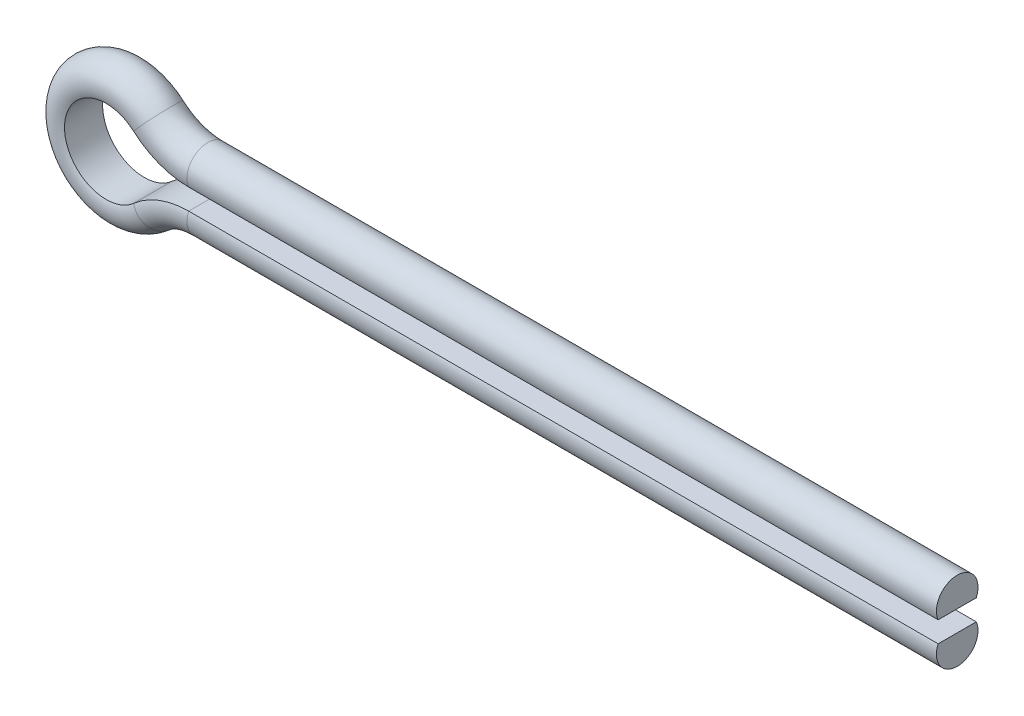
ISO-10303-21;
HEADER;
FILE_DESCRIPTION(('STEP AP214'),'2;1');
FILE_NAME('part.step','',(''),(''),'','','');
FILE_SCHEMA(('AUTOMOTIVE_DESIGN { 1 0 10303 214 1 1 1 1 }'));
ENDSEC;
DATA;
#1=APPLICATION_CONTEXT('core data for automotive mechanical design processes');
#2=APPLICATION_PROTOCOL_DEFINITION('international standard','automotive_design',2000,#1);
#3=PRODUCT_CONTEXT('',#1,'mechanical');
#4=PRODUCT('Part','Part','',(#3));
#5=PRODUCT_RELATED_PRODUCT_CATEGORY('part','',(#4));
#6=PRODUCT_DEFINITION_FORMATION('','',#4);
#7=PRODUCT_DEFINITION_CONTEXT('part definition',#1,'design');
#8=PRODUCT_DEFINITION('design','',#6,#7);
#9=PRODUCT_DEFINITION_SHAPE('','',#8);
#10=(LENGTH_UNIT() NAMED_UNIT(*) SI_UNIT(.MILLI.,.METRE.));
#11=(NAMED_UNIT(*) PLANE_ANGLE_UNIT() SI_UNIT($,.RADIAN.));
#12=(NAMED_UNIT(*) SI_UNIT($,.STERADIAN.) SOLID_ANGLE_UNIT());
#13=UNCERTAINTY_MEASURE_WITH_UNIT(LENGTH_MEASURE(1.E-05),#10,'distance_accuracy_value','');
#14=(GEOMETRIC_REPRESENTATION_CONTEXT(3) GLOBAL_UNCERTAINTY_ASSIGNED_CONTEXT((#13)) GLOBAL_UNIT_ASSIGNED_CONTEXT((#10,
#11,#12)) REPRESENTATION_CONTEXT('',''));
#15=CARTESIAN_POINT('',(0.,0.,0.));
#16=DIRECTION('',(0.,0.,1.));
#17=DIRECTION('',(1.,0.,0.));
#18=AXIS2_PLACEMENT_3D('',#15,#16,#17);
#19=CARTESIAN_POINT('',(9.92156741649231,-1.24999999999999,-2.29128784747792));
#20=DIRECTION('',(0.,1.,0.));
#21=DIRECTION('',(-1.,0.,0.));
#22=AXIS2_PLACEMENT_3D('',#19,#20,#21);
#23=PLANE('',#22);
#24=DIRECTION('',(0.,0.,1.));
#25=VECTOR('',#24,1.);
#26=CARTESIAN_POINT('',(9.92156741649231,-1.24999999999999,-2.29128784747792));
#27=LINE('',#26,#25);
#28=CARTESIAN_POINT('',(9.92156741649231,-1.24999999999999,-2.29128784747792));
#29=VERTEX_POINT('',#28);
#30=CARTESIAN_POINT('',(9.92156741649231,-1.24999999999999,2.29128784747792));
#31=VERTEX_POINT('',#30);
#32=EDGE_CURVE('E132',#29,#31,#27,.T.);
#33=ORIENTED_EDGE('',*,*,#32,.T.);
#34=DIRECTION('',(1.,0.,0.));
#35=VECTOR('',#34,1.);
#36=CARTESIAN_POINT('',(9.92156741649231,-1.24999999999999,2.29128784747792));
#37=LINE('',#36,#35);
#38=CARTESIAN_POINT('',(100.,-1.25,2.29128784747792));
#39=VERTEX_POINT('',#38);
#40=EDGE_CURVE('E35',#31,#39,#37,.T.);
#41=ORIENTED_EDGE('',*,*,#40,.T.);
#42=DIRECTION('',(0.,0.,1.));
#43=VECTOR('',#42,1.);
#44=CARTESIAN_POINT('',(100.,-1.25,-2.29128784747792));
#45=LINE('',#44,#43);
#46=CARTESIAN_POINT('',(100.,-1.25,-2.29128784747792));
#47=VERTEX_POINT('',#46);
#48=EDGE_CURVE('E42',#47,#39,#45,.T.);
#49=ORIENTED_EDGE('',*,*,#48,.F.);
#50=DIRECTION('',(1.,0.,0.));
#51=VECTOR('',#50,1.);
#52=CARTESIAN_POINT('',(9.92156741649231,-1.24999999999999,-2.29128784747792));
#53=LINE('',#52,#51);
#54=EDGE_CURVE('E11',#29,#47,#53,.T.);
#55=ORIENTED_EDGE('',*,*,#54,.F.);
#56=EDGE_LOOP('',(#33,#41,#49,#55));
#57=FACE_BOUND('',#56,.T.);
#58=ADVANCED_FACE('F28',(#57),#23,.T.);
#59=CARTESIAN_POINT('',(9.92156741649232,-2.24999999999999,0.));
#60=DIRECTION('',(1.,0.,0.));
#61=DIRECTION('',(0.,1.,0.));
#62=AXIS2_PLACEMENT_3D('',#59,#60,#61);
#63=CYLINDRICAL_SURFACE('',#62,2.5);
#64=CARTESIAN_POINT('',(9.92156741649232,-2.24999999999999,0.));
#65=DIRECTION('',(1.,0.,0.));
#66=DIRECTION('',(0.,1.,0.));
#67=AXIS2_PLACEMENT_3D('',#64,#65,#66);
#68=CIRCLE('',#67,2.5);
#69=EDGE_CURVE('E129',#31,#29,#68,.T.);
#70=ORIENTED_EDGE('',*,*,#69,.T.);
#71=ORIENTED_EDGE('',*,*,#54,.T.);
#72=CARTESIAN_POINT('',(100.,-2.25,0.));
#73=DIRECTION('',(1.,0.,0.));
#74=DIRECTION('',(0.,1.,0.));
#75=AXIS2_PLACEMENT_3D('',#72,#73,#74);
#76=CIRCLE('',#75,2.5);
#77=EDGE_CURVE('E48',#39,#47,#76,.T.);
#78=ORIENTED_EDGE('',*,*,#77,.F.);
#79=ORIENTED_EDGE('',*,*,#40,.F.);
#80=EDGE_LOOP('',(#70,#71,#78,#79));
#81=FACE_BOUND('',#80,.T.);
#82=ADVANCED_FACE('F144',(#81),#63,.T.);
#83=CARTESIAN_POINT('',(9.92156741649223,-11.25,0.));
#84=DIRECTION('',(0.,0.,-1.));
#85=DIRECTION('',(-1.,0.,0.));
#86=AXIS2_PLACEMENT_3D('',#83,#84,#85);
#87=CYLINDRICAL_SURFACE('',#86,10.);
#88=DIRECTION('',(0.,0.,1.));
#89=VECTOR('',#88,1.);
#90=CARTESIAN_POINT('',(3.3071891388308,-3.74999999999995,-2.29128784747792));
#91=LINE('',#90,#89);
#92=CARTESIAN_POINT('',(3.3071891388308,-3.74999999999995,-2.29128784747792));
#93=VERTEX_POINT('',#92);
#94=CARTESIAN_POINT('',(3.3071891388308,-3.74999999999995,2.29128784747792));
#95=VERTEX_POINT('',#94);
#96=EDGE_CURVE('E120',#93,#95,#91,.T.);
#97=ORIENTED_EDGE('',*,*,#96,.T.);
#98=CARTESIAN_POINT('',(9.92156741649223,-11.25,2.29128784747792));
#99=DIRECTION('',(0.,0.,-1.));
#100=DIRECTION('',(-1.,0.,0.));
#101=AXIS2_PLACEMENT_3D('',#98,#99,#100);
#102=CIRCLE('',#101,10.);
#103=EDGE_CURVE('E135',#95,#31,#102,.T.);
#104=ORIENTED_EDGE('',*,*,#103,.T.);
#105=ORIENTED_EDGE('',*,*,#32,.F.);
#106=CARTESIAN_POINT('',(9.92156741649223,-11.25,-2.29128784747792));
#107=DIRECTION('',(0.,0.,-1.));
#108=DIRECTION('',(-1.,0.,0.));
#109=AXIS2_PLACEMENT_3D('',#106,#107,#108);
#110=CIRCLE('',#109,10.);
#111=EDGE_CURVE('E138',#93,#29,#110,.T.);
#112=ORIENTED_EDGE('',*,*,#111,.F.);
#113=EDGE_LOOP('',(#97,#104,#105,#112));
#114=FACE_BOUND('',#113,.T.);
#115=ADVANCED_FACE('F147',(#114),#87,.T.);
#116=CARTESIAN_POINT('',(9.92156741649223,-11.25,0.));
#117=DIRECTION('',(0.,0.,-1.));
#118=DIRECTION('',(-1.,0.,0.));
#119=AXIS2_PLACEMENT_3D('',#116,#117,#118);
#120=TOROIDAL_SURFACE('',#119,9.,2.5);
#121=CARTESIAN_POINT('',(3.96862696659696,-4.49999999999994,0.));
#122=DIRECTION('',(0.74999999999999,0.661437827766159,0.));
#123=DIRECTION('',(-0.661437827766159,0.74999999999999,0.));
#124=AXIS2_PLACEMENT_3D('',#121,#122,#123);
#125=CIRCLE('',#124,2.5);
#126=EDGE_CURVE('E117',#95,#93,#125,.T.);
#127=ORIENTED_EDGE('',*,*,#126,.T.);
#128=ORIENTED_EDGE('',*,*,#111,.T.);
#129=ORIENTED_EDGE('',*,*,#69,.F.);
#130=ORIENTED_EDGE('',*,*,#103,.F.);
#131=EDGE_LOOP('',(#127,#128,#129,#130));
#132=FACE_BOUND('',#131,.T.);
#133=ADVANCED_FACE('F148',(#132),#120,.T.);
#134=CARTESIAN_POINT('',(0.,0.,0.));
#135=DIRECTION('',(0.,0.,1.));
#136=DIRECTION('',(1.,0.,0.));
#137=AXIS2_PLACEMENT_3D('',#134,#135,#136);
#138=CYLINDRICAL_SURFACE('',#137,5.);
#139=DIRECTION('',(0.,0.,1.));
#140=VECTOR('',#139,1.);
#141=CARTESIAN_POINT('',(3.30718913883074,3.75,-2.29128784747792));
#142=LINE('',#141,#140);
#143=CARTESIAN_POINT('',(3.30718913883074,3.75,-2.29128784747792));
#144=VERTEX_POINT('',#143);
#145=CARTESIAN_POINT('',(3.30718913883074,3.75,2.29128784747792));
#146=VERTEX_POINT('',#145);
#147=EDGE_CURVE('E108',#144,#146,#142,.T.);
#148=ORIENTED_EDGE('',*,*,#147,.T.);
#149=CARTESIAN_POINT('',(0.,0.,2.29128784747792));
#150=DIRECTION('',(0.,0.,1.));
#151=DIRECTION('',(1.,0.,0.));
#152=AXIS2_PLACEMENT_3D('',#149,#150,#151);
#153=CIRCLE('',#152,5.);
#154=EDGE_CURVE('E123',#146,#95,#153,.T.);
#155=ORIENTED_EDGE('',*,*,#154,.T.);
#156=ORIENTED_EDGE('',*,*,#96,.F.);
#157=CARTESIAN_POINT('',(0.,0.,-2.29128784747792));
#158=DIRECTION('',(0.,0.,1.));
#159=DIRECTION('',(1.,0.,0.));
#160=AXIS2_PLACEMENT_3D('',#157,#158,#159);
#161=CIRCLE('',#160,5.);
#162=EDGE_CURVE('E126',#144,#93,#161,.T.);
#163=ORIENTED_EDGE('',*,*,#162,.F.);
#164=EDGE_LOOP('',(#148,#155,#156,#163));
#165=FACE_BOUND('',#164,.T.);
#166=ADVANCED_FACE('F153',(#165),#138,.F.);
#167=CARTESIAN_POINT('',(0.,0.,0.));
#168=DIRECTION('',(0.,0.,1.));
#169=DIRECTION('',(1.,0.,0.));
#170=AXIS2_PLACEMENT_3D('',#167,#168,#169);
#171=TOROIDAL_SURFACE('',#170,6.,2.5);
#172=CARTESIAN_POINT('',(3.96862696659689,4.5,0.));
#173=DIRECTION('',(-0.749999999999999,0.661437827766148,0.));
#174=DIRECTION('',(-0.661437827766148,-0.749999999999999,0.));
#175=AXIS2_PLACEMENT_3D('',#172,#173,#174);
#176=CIRCLE('',#175,2.5);
#177=EDGE_CURVE('E96',#146,#144,#176,.T.);
#178=ORIENTED_EDGE('',*,*,#177,.T.);
#179=ORIENTED_EDGE('',*,*,#162,.T.);
#180=ORIENTED_EDGE('',*,*,#126,.F.);
#181=ORIENTED_EDGE('',*,*,#154,.F.);
#182=EDGE_LOOP('',(#178,#179,#180,#181));
#183=FACE_BOUND('',#182,.T.);
#184=ADVANCED_FACE('F154',(#183),#171,.T.);
#185=CARTESIAN_POINT('',(9.92156741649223,11.25,0.));
#186=DIRECTION('',(0.,0.,-1.));
#187=DIRECTION('',(-1.,0.,0.));
#188=AXIS2_PLACEMENT_3D('',#185,#186,#187);
#189=CYLINDRICAL_SURFACE('',#188,10.);
#190=DIRECTION('',(0.,0.,1.));
#191=VECTOR('',#190,1.);
#192=CARTESIAN_POINT('',(9.92156741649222,1.24999999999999,-2.29128784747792));
#193=LINE('',#192,#191);
#194=CARTESIAN_POINT('',(9.92156741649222,1.24999999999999,-2.29128784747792));
#195=VERTEX_POINT('',#194);
#196=CARTESIAN_POINT('',(9.92156741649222,1.24999999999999,2.29128784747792));
#197=VERTEX_POINT('',#196);
#198=EDGE_CURVE('E93',#195,#197,#193,.T.);
#199=ORIENTED_EDGE('',*,*,#198,.T.);
#200=CARTESIAN_POINT('',(9.92156741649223,11.25,2.29128784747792));
#201=DIRECTION('',(0.,0.,-1.));
#202=DIRECTION('',(-1.,0.,0.));
#203=AXIS2_PLACEMENT_3D('',#200,#201,#202);
#204=CIRCLE('',#203,10.);
#205=EDGE_CURVE('E111',#197,#146,#204,.T.);
#206=ORIENTED_EDGE('',*,*,#205,.T.);
#207=ORIENTED_EDGE('',*,*,#147,.F.);
#208=CARTESIAN_POINT('',(9.92156741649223,11.25,-2.29128784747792));
#209=DIRECTION('',(0.,0.,-1.));
#210=DIRECTION('',(-1.,0.,0.));
#211=AXIS2_PLACEMENT_3D('',#208,#209,#210);
#212=CIRCLE('',#211,10.);
#213=EDGE_CURVE('E114',#195,#144,#212,.T.);
#214=ORIENTED_EDGE('',*,*,#213,.F.);
#215=EDGE_LOOP('',(#199,#206,#207,#214));
#216=FACE_BOUND('',#215,.T.);
#217=ADVANCED_FACE('F159',(#216),#189,.T.);
#218=CARTESIAN_POINT('',(9.92156741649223,11.25,0.));
#219=DIRECTION('',(0.,0.,-1.));
#220=DIRECTION('',(-1.,0.,0.));
#221=AXIS2_PLACEMENT_3D('',#218,#219,#220);
#222=TOROIDAL_SURFACE('',#221,9.,2.5);
#223=CARTESIAN_POINT('',(9.92156741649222,2.24999999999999,0.));
#224=DIRECTION('',(-1.,0.,0.));
#225=DIRECTION('',(0.,-1.,0.));
#226=AXIS2_PLACEMENT_3D('',#223,#224,#225);
#227=CIRCLE('',#226,2.5);
#228=EDGE_CURVE('E86',#197,#195,#227,.T.);
#229=ORIENTED_EDGE('',*,*,#228,.T.);
#230=ORIENTED_EDGE('',*,*,#213,.T.);
#231=ORIENTED_EDGE('',*,*,#177,.F.);
#232=ORIENTED_EDGE('',*,*,#205,.F.);
#233=EDGE_LOOP('',(#229,#230,#231,#232));
#234=FACE_BOUND('',#233,.T.);
#235=ADVANCED_FACE('F160',(#234),#222,.T.);
#236=CARTESIAN_POINT('',(9.92156741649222,2.24999999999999,0.));
#237=DIRECTION('',(1.,0.,0.));
#238=DIRECTION('',(0.,1.,0.));
#239=AXIS2_PLACEMENT_3D('',#236,#237,#238);
#240=CYLINDRICAL_SURFACE('',#239,2.5);
#241=CARTESIAN_POINT('',(100.,2.25,0.));
#242=DIRECTION('',(-1.,0.,0.));
#243=DIRECTION('',(0.,-1.,0.));
#244=AXIS2_PLACEMENT_3D('',#241,#242,#243);
#245=CIRCLE('',#244,2.5);
#246=CARTESIAN_POINT('',(100.,1.25,2.29128784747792));
#247=VERTEX_POINT('',#246);
#248=CARTESIAN_POINT('',(100.,1.25,-2.29128784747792));
#249=VERTEX_POINT('',#248);
#250=EDGE_CURVE('E82',#247,#249,#245,.T.);
#251=ORIENTED_EDGE('',*,*,#250,.T.);
#252=DIRECTION('',(1.,0.,0.));
#253=VECTOR('',#252,1.);
#254=CARTESIAN_POINT('',(9.92156741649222,1.24999999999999,-2.29128784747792));
#255=LINE('',#254,#253);
#256=EDGE_CURVE('E90',#195,#249,#255,.T.);
#257=ORIENTED_EDGE('',*,*,#256,.F.);
#258=ORIENTED_EDGE('',*,*,#228,.F.);
#259=DIRECTION('',(1.,0.,0.));
#260=VECTOR('',#259,1.);
#261=CARTESIAN_POINT('',(9.92156741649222,1.24999999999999,2.29128784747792));
#262=LINE('',#261,#260);
#263=EDGE_CURVE('E97',#197,#247,#262,.T.);
#264=ORIENTED_EDGE('',*,*,#263,.T.);
#265=EDGE_LOOP('',(#251,#257,#258,#264));
#266=FACE_BOUND('',#265,.T.);
#267=ADVANCED_FACE('F99',(#266),#240,.T.);
#268=CARTESIAN_POINT('',(9.92156741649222,1.24999999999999,-2.29128784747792));
#269=DIRECTION('',(0.,1.,0.));
#270=DIRECTION('',(-1.,0.,0.));
#271=AXIS2_PLACEMENT_3D('',#268,#269,#270);
#272=PLANE('',#271);
#273=DIRECTION('',(0.,0.,1.));
#274=VECTOR('',#273,1.);
#275=CARTESIAN_POINT('',(100.,1.25,-2.29128784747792));
#276=LINE('',#275,#274);
#277=EDGE_CURVE('E78',#249,#247,#276,.T.);
#278=ORIENTED_EDGE('',*,*,#277,.T.);
#279=ORIENTED_EDGE('',*,*,#263,.F.);
#280=ORIENTED_EDGE('',*,*,#198,.F.);
#281=ORIENTED_EDGE('',*,*,#256,.T.);
#282=EDGE_LOOP('',(#278,#279,#280,#281));
#283=FACE_BOUND('',#282,.T.);
#284=ADVANCED_FACE('F91',(#283),#272,.F.);
#285=CARTESIAN_POINT('',(100.,-2.25,0.));
#286=DIRECTION('',(1.,0.,0.));
#287=DIRECTION('',(0.,1.,0.));
#288=AXIS2_PLACEMENT_3D('',#285,#286,#287);
#289=PLANE('',#288);
#290=ORIENTED_EDGE('',*,*,#77,.T.);
#291=ORIENTED_EDGE('',*,*,#48,.T.);
#292=EDGE_LOOP('',(#290,#291));
#293=FACE_BOUND('',#292,.T.);
#294=ADVANCED_FACE('F204',(#293),#289,.T.);
#295=CARTESIAN_POINT('',(100.,2.25,0.));
#296=DIRECTION('',(-1.,0.,0.));
#297=DIRECTION('',(0.,-1.,0.));
#298=AXIS2_PLACEMENT_3D('',#295,#296,#297);
#299=PLANE('',#298);
#300=ORIENTED_EDGE('',*,*,#250,.F.);
#301=ORIENTED_EDGE('',*,*,#277,.F.);
#302=EDGE_LOOP('',(#300,#301));
#303=FACE_BOUND('',#302,.T.);
#304=ADVANCED_FACE('F80',(#303),#299,.F.);
#305=CLOSED_SHELL('',(#58,#82,#115,#133,#166,#184,#217,#235,#267,#284,#294,#304));
#306=MANIFOLD_SOLID_BREP('B2',#305);
#307=ADVANCED_BREP_SHAPE_REPRESENTATION('',(#18,#306),#14);
#308=SHAPE_DEFINITION_REPRESENTATION(#9,#307);
ENDSEC;
END-ISO-10303-21;
